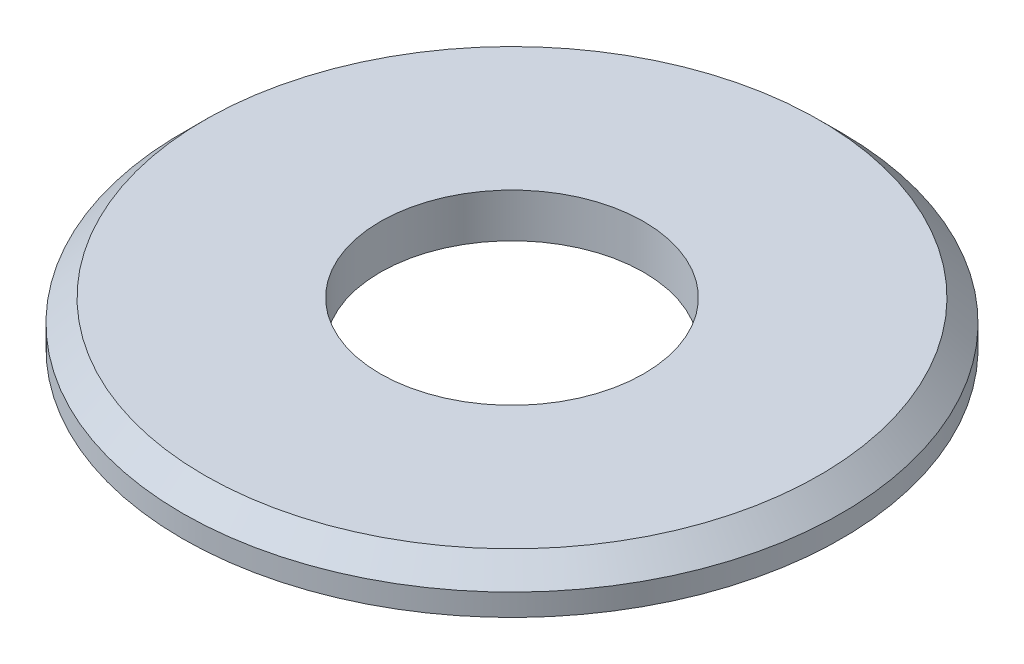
ISO-10303-21;
HEADER;
FILE_DESCRIPTION(('STEP AP214'),'2;1');
FILE_NAME('part.step','',(''),(''),'','','');
FILE_SCHEMA(('AUTOMOTIVE_DESIGN { 1 0 10303 214 1 1 1 1 }'));
ENDSEC;
DATA;
#1=APPLICATION_CONTEXT('core data for automotive mechanical design processes');
#2=APPLICATION_PROTOCOL_DEFINITION('international standard','automotive_design',2000,#1);
#3=PRODUCT_CONTEXT('',#1,'mechanical');
#4=PRODUCT('Part','Part','',(#3));
#5=PRODUCT_RELATED_PRODUCT_CATEGORY('part','',(#4));
#6=PRODUCT_DEFINITION_FORMATION('','',#4);
#7=PRODUCT_DEFINITION_CONTEXT('part definition',#1,'design');
#8=PRODUCT_DEFINITION('design','',#6,#7);
#9=PRODUCT_DEFINITION_SHAPE('','',#8);
#10=(LENGTH_UNIT() NAMED_UNIT(*) SI_UNIT(.MILLI.,.METRE.));
#11=(NAMED_UNIT(*) PLANE_ANGLE_UNIT() SI_UNIT($,.RADIAN.));
#12=(NAMED_UNIT(*) SI_UNIT($,.STERADIAN.) SOLID_ANGLE_UNIT());
#13=UNCERTAINTY_MEASURE_WITH_UNIT(LENGTH_MEASURE(1.E-05),#10,'distance_accuracy_value','');
#14=(GEOMETRIC_REPRESENTATION_CONTEXT(3) GLOBAL_UNCERTAINTY_ASSIGNED_CONTEXT((#13)) GLOBAL_UNIT_ASSIGNED_CONTEXT((#10,
#11,#12)) REPRESENTATION_CONTEXT('',''));
#15=CARTESIAN_POINT('',(0.,0.,0.));
#16=DIRECTION('',(0.,0.,1.));
#17=DIRECTION('',(1.,0.,0.));
#18=AXIS2_PLACEMENT_3D('',#15,#16,#17);
#19=CARTESIAN_POINT('',(0.,0.3,0.));
#20=DIRECTION('',(0.,1.,0.));
#21=DIRECTION('',(0.,0.,1.));
#22=AXIS2_PLACEMENT_3D('',#19,#20,#21);
#23=PLANE('',#22);
#24=CARTESIAN_POINT('',(0.,0.3,0.));
#25=DIRECTION('',(0.,1.,0.));
#26=DIRECTION('',(0.,0.,1.));
#27=AXIS2_PLACEMENT_3D('',#24,#25,#26);
#28=CIRCLE('',#27,2.1);
#29=CARTESIAN_POINT('',(0.,0.3,2.1));
#30=VERTEX_POINT('',#29);
#31=EDGE_CURVE('E35',#30,#30,#28,.T.);
#32=ORIENTED_EDGE('',*,*,#31,.T.);
#33=EDGE_LOOP('',(#32));
#34=FACE_BOUND('',#33,.T.);
#35=CARTESIAN_POINT('',(0.,0.3,0.));
#36=DIRECTION('',(0.,1.,0.));
#37=DIRECTION('',(0.,0.,1.));
#38=AXIS2_PLACEMENT_3D('',#35,#36,#37);
#39=CIRCLE('',#38,0.9);
#40=CARTESIAN_POINT('',(0.,0.3,0.9));
#41=VERTEX_POINT('',#40);
#42=EDGE_CURVE('E43',#41,#41,#39,.T.);
#43=ORIENTED_EDGE('',*,*,#42,.F.);
#44=EDGE_LOOP('',(#43));
#45=FACE_BOUND('',#44,.T.);
#46=ADVANCED_FACE('F28',(#34,#45),#23,.T.);
#47=CARTESIAN_POINT('',(0.,0.,0.));
#48=DIRECTION('',(0.,1.,0.));
#49=DIRECTION('',(0.,0.,1.));
#50=AXIS2_PLACEMENT_3D('',#47,#48,#49);
#51=PLANE('',#50);
#52=CARTESIAN_POINT('',(0.,0.,0.));
#53=DIRECTION('',(0.,1.,0.));
#54=DIRECTION('',(0.,0.,1.));
#55=AXIS2_PLACEMENT_3D('',#52,#53,#54);
#56=CIRCLE('',#55,2.25);
#57=CARTESIAN_POINT('',(0.,0.,2.25));
#58=VERTEX_POINT('',#57);
#59=EDGE_CURVE('E39',#58,#58,#56,.T.);
#60=ORIENTED_EDGE('',*,*,#59,.F.);
#61=EDGE_LOOP('',(#60));
#62=FACE_BOUND('',#61,.T.);
#63=CARTESIAN_POINT('',(0.,0.,0.));
#64=DIRECTION('',(0.,1.,0.));
#65=DIRECTION('',(0.,0.,1.));
#66=AXIS2_PLACEMENT_3D('',#63,#64,#65);
#67=CIRCLE('',#66,0.9);
#68=CARTESIAN_POINT('',(0.,0.,0.9));
#69=VERTEX_POINT('',#68);
#70=EDGE_CURVE('E48',#69,#69,#67,.T.);
#71=ORIENTED_EDGE('',*,*,#70,.T.);
#72=EDGE_LOOP('',(#71));
#73=FACE_BOUND('',#72,.T.);
#74=ADVANCED_FACE('F52',(#62,#73),#51,.F.);
#75=CARTESIAN_POINT('',(0.,0.3,0.));
#76=DIRECTION('',(0.,-1.,0.));
#77=DIRECTION('',(0.,0.,-1.));
#78=AXIS2_PLACEMENT_3D('',#75,#76,#77);
#79=CYLINDRICAL_SURFACE('',#78,2.25);
#80=CARTESIAN_POINT('',(0.,0.149999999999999,0.));
#81=DIRECTION('',(0.,1.,0.));
#82=DIRECTION('',(0.,0.,1.));
#83=AXIS2_PLACEMENT_3D('',#80,#81,#82);
#84=CIRCLE('',#83,2.25);
#85=CARTESIAN_POINT('',(0.,0.149999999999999,2.25));
#86=VERTEX_POINT('',#85);
#87=EDGE_CURVE('E10',#86,#86,#84,.F.);
#88=ORIENTED_EDGE('',*,*,#87,.T.);
#89=EDGE_LOOP('',(#88));
#90=FACE_BOUND('',#89,.T.);
#91=ORIENTED_EDGE('',*,*,#59,.T.);
#92=EDGE_LOOP('',(#91));
#93=FACE_BOUND('',#92,.T.);
#94=ADVANCED_FACE('F30',(#90,#93),#79,.T.);
#95=CARTESIAN_POINT('',(0.,0.3,0.));
#96=DIRECTION('',(0.,-1.,0.));
#97=DIRECTION('',(0.,0.,-1.));
#98=AXIS2_PLACEMENT_3D('',#95,#96,#97);
#99=CYLINDRICAL_SURFACE('',#98,0.9);
#100=ORIENTED_EDGE('',*,*,#42,.T.);
#101=EDGE_LOOP('',(#100));
#102=FACE_BOUND('',#101,.T.);
#103=ORIENTED_EDGE('',*,*,#70,.F.);
#104=EDGE_LOOP('',(#103));
#105=FACE_BOUND('',#104,.T.);
#106=ADVANCED_FACE('F54',(#102,#105),#99,.F.);
#107=CARTESIAN_POINT('',(0.,0.3,0.));
#108=DIRECTION('',(0.,-1.,0.));
#109=DIRECTION('',(0.,0.,-1.));
#110=AXIS2_PLACEMENT_3D('',#107,#108,#109);
#111=CONICAL_SURFACE('',#110,2.1,0.785398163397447);
#112=ORIENTED_EDGE('',*,*,#87,.F.);
#113=EDGE_LOOP('',(#112));
#114=FACE_BOUND('',#113,.T.);
#115=ORIENTED_EDGE('',*,*,#31,.F.);
#116=EDGE_LOOP('',(#115));
#117=FACE_BOUND('',#116,.T.);
#118=ADVANCED_FACE('F56',(#114,#117),#111,.T.);
#119=CLOSED_SHELL('',(#46,#74,#94,#106,#118));
#120=MANIFOLD_SOLID_BREP('B2',#119);
#121=ADVANCED_BREP_SHAPE_REPRESENTATION('',(#18,#120),#14);
#122=SHAPE_DEFINITION_REPRESENTATION(#9,#121);
ENDSEC;
END-ISO-10303-21;
